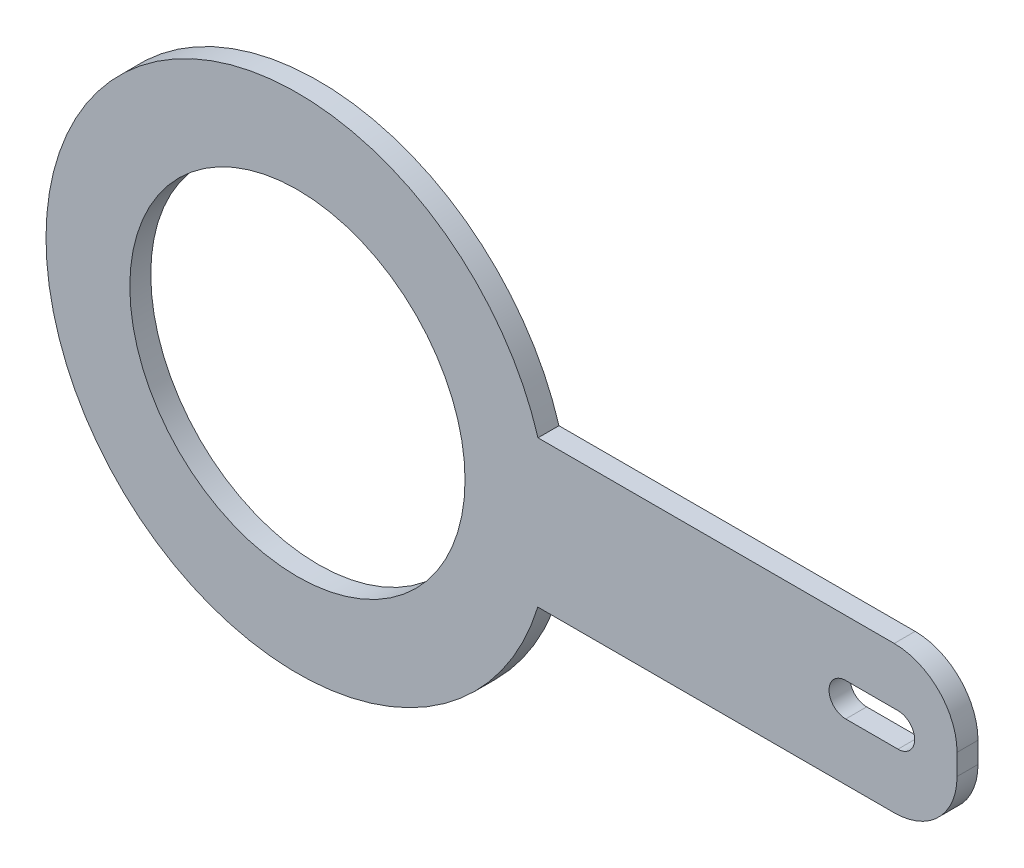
from build123d import *

# Parameters (mm, degrees)
SKETCH1_R           = 4
BOSS_EXTRUDE1_DEPTH = 0.5
CUT_EXTRUDE1_DEPTH  = 0.5


with BuildPart() as part:
    # Sketch1 → Boss-Extrude1 (new body)
    with BuildSketch(Plane.XY):
        with BuildLine():
            Line((5.741757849, 1.741326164), (14.241757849, 1.741326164))
            ThreePointArc((14.241757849, 1.741326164), (15.30241802, 1.301986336), (15.741757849, 0.241326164))
            Line((15.741757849, 0.241326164), (15.741757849, -0.258673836))
            ThreePointArc((15.741757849, -0.258673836), (15.30241802, -1.319334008), (14.241757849, -1.758673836))
            Line((14.241757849, -1.758673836), (5.736468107, -1.758673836))
            ThreePointArc((5.736468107, -1.758673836), (-5.999993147, 0.009068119), (5.741757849, 1.741326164))
        make_face()
        Circle(SKETCH1_R, mode=Mode.SUBTRACT)
    extrude(amount=BOSS_EXTRUDE1_DEPTH)

    # Sketch2 → Cut-Extrude1 (cut)
    with BuildSketch(Plane.XY.offset(0.5)):
        with BuildLine():
            Line((13.084996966, 0.397804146), (14.332166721, 0.397804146))
            ThreePointArc((14.332166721, 0.397804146), (14.729970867, 0), (14.332166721, -0.397804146))
            Line((14.332166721, -0.397804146), (13.084996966, -0.397804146))
            ThreePointArc((13.084996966, -0.397804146), (12.68719282, 0), (13.084996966, 0.397804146))
        make_face()
    extrude(amount=-CUT_EXTRUDE1_DEPTH, mode=Mode.SUBTRACT)


solid = part.part
